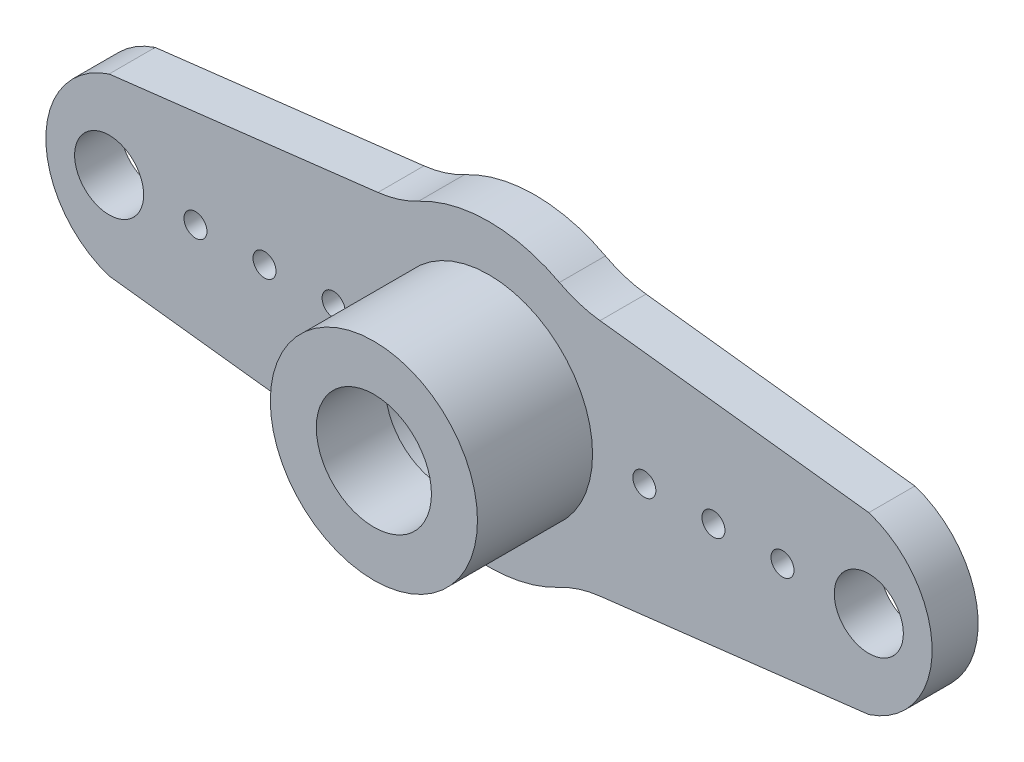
ISO-10303-21;
HEADER;
FILE_DESCRIPTION(('STEP AP214'),'2;1');
FILE_NAME('part.step','',(''),(''),'','','');
FILE_SCHEMA(('AUTOMOTIVE_DESIGN { 1 0 10303 214 1 1 1 1 }'));
ENDSEC;
DATA;
#1=APPLICATION_CONTEXT('core data for automotive mechanical design processes');
#2=APPLICATION_PROTOCOL_DEFINITION('international standard','automotive_design',2000,#1);
#3=PRODUCT_CONTEXT('',#1,'mechanical');
#4=PRODUCT('Part','Part','',(#3));
#5=PRODUCT_RELATED_PRODUCT_CATEGORY('part','',(#4));
#6=PRODUCT_DEFINITION_FORMATION('','',#4);
#7=PRODUCT_DEFINITION_CONTEXT('part definition',#1,'design');
#8=PRODUCT_DEFINITION('design','',#6,#7);
#9=PRODUCT_DEFINITION_SHAPE('','',#8);
#10=(LENGTH_UNIT() NAMED_UNIT(*) SI_UNIT(.MILLI.,.METRE.));
#11=(NAMED_UNIT(*) PLANE_ANGLE_UNIT() SI_UNIT($,.RADIAN.));
#12=(NAMED_UNIT(*) SI_UNIT($,.STERADIAN.) SOLID_ANGLE_UNIT());
#13=UNCERTAINTY_MEASURE_WITH_UNIT(LENGTH_MEASURE(1.E-05),#10,'distance_accuracy_value','');
#14=(GEOMETRIC_REPRESENTATION_CONTEXT(3) GLOBAL_UNCERTAINTY_ASSIGNED_CONTEXT((#13)) GLOBAL_UNIT_ASSIGNED_CONTEXT((#10,
#11,#12)) REPRESENTATION_CONTEXT('',''));
#15=CARTESIAN_POINT('',(0.,0.,0.));
#16=DIRECTION('',(0.,0.,1.));
#17=DIRECTION('',(1.,0.,0.));
#18=AXIS2_PLACEMENT_3D('',#15,#16,#17);
#19=CARTESIAN_POINT('',(0.,0.,7.));
#20=DIRECTION('',(0.,0.,-1.));
#21=DIRECTION('',(-1.,0.,0.));
#22=AXIS2_PLACEMENT_3D('',#19,#20,#21);
#23=CYLINDRICAL_SURFACE('',#22,2.5);
#24=CARTESIAN_POINT('',(0.,0.,7.));
#25=DIRECTION('',(0.,0.,1.));
#26=DIRECTION('',(1.,0.,0.));
#27=AXIS2_PLACEMENT_3D('',#24,#25,#26);
#28=CIRCLE('',#27,2.5);
#29=CARTESIAN_POINT('',(2.5,0.,7.));
#30=VERTEX_POINT('',#29);
#31=EDGE_CURVE('E254',#30,#30,#28,.T.);
#32=ORIENTED_EDGE('',*,*,#31,.T.);
#33=EDGE_LOOP('',(#32));
#34=FACE_BOUND('',#33,.T.);
#35=CARTESIAN_POINT('',(0.,0.,4.));
#36=DIRECTION('',(0.,0.,-1.));
#37=DIRECTION('',(-1.,0.,0.));
#38=AXIS2_PLACEMENT_3D('',#35,#36,#37);
#39=CIRCLE('',#38,2.5);
#40=CARTESIAN_POINT('',(-2.5,0.,4.));
#41=VERTEX_POINT('',#40);
#42=EDGE_CURVE('E219',#41,#41,#39,.T.);
#43=ORIENTED_EDGE('',*,*,#42,.T.);
#44=EDGE_LOOP('',(#43));
#45=FACE_BOUND('',#44,.T.);
#46=ADVANCED_FACE('F34',(#34,#45),#23,.F.);
#47=CARTESIAN_POINT('',(-5.41101843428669,10.1474567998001,2.));
#48=DIRECTION('',(0.,0.,1.));
#49=DIRECTION('',(1.,0.,0.));
#50=AXIS2_PLACEMENT_3D('',#47,#48,#49);
#51=PLANE('',#50);
#52=CARTESIAN_POINT('',(-16.5,0.,2.));
#53=DIRECTION('',(0.,0.,1.));
#54=DIRECTION('',(1.,0.,0.));
#55=AXIS2_PLACEMENT_3D('',#52,#53,#54);
#56=CIRCLE('',#55,1.5);
#57=CARTESIAN_POINT('',(-15.,0.,2.));
#58=VERTEX_POINT('',#57);
#59=EDGE_CURVE('E236',#58,#58,#56,.T.);
#60=ORIENTED_EDGE('',*,*,#59,.F.);
#61=EDGE_LOOP('',(#60));
#62=FACE_BOUND('',#61,.T.);
#63=CARTESIAN_POINT('',(16.5,0.,2.));
#64=DIRECTION('',(0.,0.,1.));
#65=DIRECTION('',(1.,0.,0.));
#66=AXIS2_PLACEMENT_3D('',#63,#64,#65);
#67=CIRCLE('',#66,1.5);
#68=CARTESIAN_POINT('',(18.,0.,2.));
#69=VERTEX_POINT('',#68);
#70=EDGE_CURVE('E226',#69,#69,#67,.T.);
#71=ORIENTED_EDGE('',*,*,#70,.F.);
#72=EDGE_LOOP('',(#71));
#73=FACE_BOUND('',#72,.T.);
#74=CARTESIAN_POINT('',(12.75,0.,2.));
#75=DIRECTION('',(0.,0.,1.));
#76=DIRECTION('',(-1.,0.,0.));
#77=AXIS2_PLACEMENT_3D('',#74,#75,#76);
#78=CIRCLE('',#77,0.499999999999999);
#79=CARTESIAN_POINT('',(12.25,0.,2.));
#80=VERTEX_POINT('',#79);
#81=EDGE_CURVE('E270',#80,#80,#78,.T.);
#82=ORIENTED_EDGE('',*,*,#81,.F.);
#83=EDGE_LOOP('',(#82));
#84=FACE_BOUND('',#83,.T.);
#85=CARTESIAN_POINT('',(6.75,0.,2.));
#86=DIRECTION('',(0.,0.,1.));
#87=DIRECTION('',(-1.,0.,0.));
#88=AXIS2_PLACEMENT_3D('',#85,#86,#87);
#89=CIRCLE('',#88,0.499999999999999);
#90=CARTESIAN_POINT('',(6.25,0.,2.));
#91=VERTEX_POINT('',#90);
#92=EDGE_CURVE('E282',#91,#91,#89,.T.);
#93=ORIENTED_EDGE('',*,*,#92,.F.);
#94=EDGE_LOOP('',(#93));
#95=FACE_BOUND('',#94,.T.);
#96=CARTESIAN_POINT('',(-9.75,0.,2.));
#97=DIRECTION('',(0.,0.,1.));
#98=DIRECTION('',(1.,0.,0.));
#99=AXIS2_PLACEMENT_3D('',#96,#97,#98);
#100=CIRCLE('',#99,0.499999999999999);
#101=CARTESIAN_POINT('',(-9.25,0.,2.));
#102=VERTEX_POINT('',#101);
#103=EDGE_CURVE('E300',#102,#102,#100,.T.);
#104=ORIENTED_EDGE('',*,*,#103,.F.);
#105=EDGE_LOOP('',(#104));
#106=FACE_BOUND('',#105,.T.);
#107=CARTESIAN_POINT('',(-5.41101843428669,10.1474567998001,2.));
#108=DIRECTION('',(0.,0.,-1.));
#109=DIRECTION('',(1.,0.,0.));
#110=AXIS2_PLACEMENT_3D('',#107,#108,#109);
#111=CIRCLE('',#110,5.);
#112=CARTESIAN_POINT('',(-3.05840172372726,5.73551906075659,2.));
#113=VERTEX_POINT('',#112);
#114=CARTESIAN_POINT('',(-4.82315587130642,5.18213529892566,2.));
#115=VERTEX_POINT('',#114);
#116=EDGE_CURVE('E193',#113,#115,#111,.T.);
#117=ORIENTED_EDGE('',*,*,#116,.T.);
#118=DIRECTION('',(-0.993064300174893,-0.117572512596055,0.));
#119=VECTOR('',#118,1.);
#120=CARTESIAN_POINT('',(-16.5,3.79967103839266,2.));
#121=LINE('',#120,#119);
#122=CARTESIAN_POINT('',(-16.5,3.79967103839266,2.));
#123=VERTEX_POINT('',#122);
#124=EDGE_CURVE('E113',#115,#123,#121,.T.);
#125=ORIENTED_EDGE('',*,*,#124,.T.);
#126=CARTESIAN_POINT('',(-15.25,0.,2.));
#127=DIRECTION('',(0.,0.,1.));
#128=DIRECTION('',(1.,0.,0.));
#129=AXIS2_PLACEMENT_3D('',#126,#127,#128);
#130=CIRCLE('',#129,4.);
#131=CARTESIAN_POINT('',(-16.5,-3.79967103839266,2.));
#132=VERTEX_POINT('',#131);
#133=EDGE_CURVE('E312',#123,#132,#130,.T.);
#134=ORIENTED_EDGE('',*,*,#133,.T.);
#135=DIRECTION('',(0.993064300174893,-0.117572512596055,0.));
#136=VECTOR('',#135,1.);
#137=CARTESIAN_POINT('',(-16.5,-3.79967103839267,2.));
#138=LINE('',#137,#136);
#139=CARTESIAN_POINT('',(-4.82315587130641,-5.18213529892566,2.));
#140=VERTEX_POINT('',#139);
#141=EDGE_CURVE('E314',#132,#140,#138,.T.);
#142=ORIENTED_EDGE('',*,*,#141,.T.);
#143=CARTESIAN_POINT('',(-5.41101843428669,-10.1474567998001,2.));
#144=DIRECTION('',(0.,0.,-1.));
#145=DIRECTION('',(-1.,0.,0.));
#146=AXIS2_PLACEMENT_3D('',#143,#144,#145);
#147=CIRCLE('',#146,5.);
#148=CARTESIAN_POINT('',(-3.05840172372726,-5.73551906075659,2.));
#149=VERTEX_POINT('',#148);
#150=EDGE_CURVE('E316',#140,#149,#147,.T.);
#151=ORIENTED_EDGE('',*,*,#150,.T.);
#152=CARTESIAN_POINT('',(0.,0.,2.));
#153=DIRECTION('',(0.,0.,1.));
#154=DIRECTION('',(1.,0.,0.));
#155=AXIS2_PLACEMENT_3D('',#152,#153,#154);
#156=CIRCLE('',#155,6.5);
#157=CARTESIAN_POINT('',(3.05840172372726,-5.73551906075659,2.));
#158=VERTEX_POINT('',#157);
#159=EDGE_CURVE('E318',#149,#158,#156,.T.);
#160=ORIENTED_EDGE('',*,*,#159,.T.);
#161=CARTESIAN_POINT('',(5.41101843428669,-10.1474567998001,2.));
#162=DIRECTION('',(0.,0.,-1.));
#163=DIRECTION('',(-1.,0.,0.));
#164=AXIS2_PLACEMENT_3D('',#161,#162,#163);
#165=CIRCLE('',#164,5.);
#166=CARTESIAN_POINT('',(4.82315587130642,-5.18213529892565,2.));
#167=VERTEX_POINT('',#166);
#168=EDGE_CURVE('E320',#158,#167,#165,.T.);
#169=ORIENTED_EDGE('',*,*,#168,.T.);
#170=DIRECTION('',(0.993064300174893,0.117572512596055,0.));
#171=VECTOR('',#170,1.);
#172=CARTESIAN_POINT('',(16.5,-3.79967103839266,2.));
#173=LINE('',#172,#171);
#174=CARTESIAN_POINT('',(16.5,-3.79967103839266,2.));
#175=VERTEX_POINT('',#174);
#176=EDGE_CURVE('E322',#167,#175,#173,.T.);
#177=ORIENTED_EDGE('',*,*,#176,.T.);
#178=CARTESIAN_POINT('',(15.25,0.,2.));
#179=DIRECTION('',(0.,0.,1.));
#180=DIRECTION('',(-1.,0.,0.));
#181=AXIS2_PLACEMENT_3D('',#178,#179,#180);
#182=CIRCLE('',#181,4.);
#183=CARTESIAN_POINT('',(16.5,3.79967103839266,2.));
#184=VERTEX_POINT('',#183);
#185=EDGE_CURVE('E148',#175,#184,#182,.T.);
#186=ORIENTED_EDGE('',*,*,#185,.T.);
#187=DIRECTION('',(-0.993064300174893,0.117572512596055,0.));
#188=VECTOR('',#187,1.);
#189=CARTESIAN_POINT('',(16.5,3.79967103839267,2.));
#190=LINE('',#189,#188);
#191=CARTESIAN_POINT('',(4.82315587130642,5.18213529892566,2.));
#192=VERTEX_POINT('',#191);
#193=EDGE_CURVE('E140',#184,#192,#190,.T.);
#194=ORIENTED_EDGE('',*,*,#193,.T.);
#195=CARTESIAN_POINT('',(5.41101843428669,10.1474567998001,2.));
#196=DIRECTION('',(0.,0.,-1.));
#197=DIRECTION('',(1.,0.,0.));
#198=AXIS2_PLACEMENT_3D('',#195,#196,#197);
#199=CIRCLE('',#198,5.);
#200=CARTESIAN_POINT('',(3.05840172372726,5.73551906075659,2.));
#201=VERTEX_POINT('',#200);
#202=EDGE_CURVE('E145',#192,#201,#199,.T.);
#203=ORIENTED_EDGE('',*,*,#202,.T.);
#204=CARTESIAN_POINT('',(0.,0.,2.));
#205=DIRECTION('',(0.,0.,1.));
#206=DIRECTION('',(1.,0.,0.));
#207=AXIS2_PLACEMENT_3D('',#204,#205,#206);
#208=CIRCLE('',#207,6.5);
#209=EDGE_CURVE('E59',#201,#113,#208,.T.);
#210=ORIENTED_EDGE('',*,*,#209,.T.);
#211=EDGE_LOOP('',(#117,#125,#134,#142,#151,#160,#169,#177,#186,#194,#203,#210));
#212=FACE_BOUND('',#211,.T.);
#213=CARTESIAN_POINT('',(-12.75,0.,2.));
#214=DIRECTION('',(0.,0.,1.));
#215=DIRECTION('',(1.,0.,0.));
#216=AXIS2_PLACEMENT_3D('',#213,#214,#215);
#217=CIRCLE('',#216,0.499999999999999);
#218=CARTESIAN_POINT('',(-12.25,0.,2.));
#219=VERTEX_POINT('',#218);
#220=EDGE_CURVE('E173',#219,#219,#217,.T.);
#221=ORIENTED_EDGE('',*,*,#220,.F.);
#222=EDGE_LOOP('',(#221));
#223=FACE_BOUND('',#222,.T.);
#224=CARTESIAN_POINT('',(-6.75,0.,2.));
#225=DIRECTION('',(0.,0.,1.));
#226=DIRECTION('',(1.,0.,0.));
#227=AXIS2_PLACEMENT_3D('',#224,#225,#226);
#228=CIRCLE('',#227,0.500000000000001);
#229=CARTESIAN_POINT('',(-6.25,0.,2.));
#230=VERTEX_POINT('',#229);
#231=EDGE_CURVE('E294',#230,#230,#228,.T.);
#232=ORIENTED_EDGE('',*,*,#231,.F.);
#233=EDGE_LOOP('',(#232));
#234=FACE_BOUND('',#233,.T.);
#235=CARTESIAN_POINT('',(9.75,0.,2.));
#236=DIRECTION('',(0.,0.,1.));
#237=DIRECTION('',(-1.,0.,0.));
#238=AXIS2_PLACEMENT_3D('',#235,#236,#237);
#239=CIRCLE('',#238,0.499999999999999);
#240=CARTESIAN_POINT('',(9.25,0.,2.));
#241=VERTEX_POINT('',#240);
#242=EDGE_CURVE('E276',#241,#241,#239,.T.);
#243=ORIENTED_EDGE('',*,*,#242,.F.);
#244=EDGE_LOOP('',(#243));
#245=FACE_BOUND('',#244,.T.);
#246=CARTESIAN_POINT('',(0.,0.,2.));
#247=DIRECTION('',(0.,0.,1.));
#248=DIRECTION('',(1.,0.,0.));
#249=AXIS2_PLACEMENT_3D('',#246,#247,#248);
#250=CIRCLE('',#249,4.5);
#251=CARTESIAN_POINT('',(4.5,0.,2.));
#252=VERTEX_POINT('',#251);
#253=EDGE_CURVE('E257',#252,#252,#250,.T.);
#254=ORIENTED_EDGE('',*,*,#253,.F.);
#255=EDGE_LOOP('',(#254));
#256=FACE_BOUND('',#255,.T.);
#257=ADVANCED_FACE('F142',(#62,#73,#84,#95,#106,#212,#223,#234,#245,#256),#51,.T.);
#258=CARTESIAN_POINT('',(-5.41101843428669,10.1474567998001,0.));
#259=DIRECTION('',(0.,0.,1.));
#260=DIRECTION('',(1.,0.,0.));
#261=AXIS2_PLACEMENT_3D('',#258,#259,#260);
#262=PLANE('',#261);
#263=CARTESIAN_POINT('',(-16.5,0.,0.));
#264=DIRECTION('',(0.,0.,1.));
#265=DIRECTION('',(1.,0.,0.));
#266=AXIS2_PLACEMENT_3D('',#263,#264,#265);
#267=CIRCLE('',#266,1.5);
#268=CARTESIAN_POINT('',(-15.,0.,0.));
#269=VERTEX_POINT('',#268);
#270=EDGE_CURVE('E38',#269,#269,#267,.T.);
#271=ORIENTED_EDGE('',*,*,#270,.T.);
#272=EDGE_LOOP('',(#271));
#273=FACE_BOUND('',#272,.T.);
#274=CARTESIAN_POINT('',(16.5,0.,0.));
#275=DIRECTION('',(0.,0.,1.));
#276=DIRECTION('',(1.,0.,0.));
#277=AXIS2_PLACEMENT_3D('',#274,#275,#276);
#278=CIRCLE('',#277,1.5);
#279=CARTESIAN_POINT('',(18.,0.,0.));
#280=VERTEX_POINT('',#279);
#281=EDGE_CURVE('E223',#280,#280,#278,.T.);
#282=ORIENTED_EDGE('',*,*,#281,.T.);
#283=EDGE_LOOP('',(#282));
#284=FACE_BOUND('',#283,.T.);
#285=CARTESIAN_POINT('',(12.75,0.,0.));
#286=DIRECTION('',(0.,0.,1.));
#287=DIRECTION('',(-1.,0.,0.));
#288=AXIS2_PLACEMENT_3D('',#285,#286,#287);
#289=CIRCLE('',#288,0.499999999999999);
#290=CARTESIAN_POINT('',(12.25,0.,0.));
#291=VERTEX_POINT('',#290);
#292=EDGE_CURVE('E269',#291,#291,#289,.T.);
#293=ORIENTED_EDGE('',*,*,#292,.T.);
#294=EDGE_LOOP('',(#293));
#295=FACE_BOUND('',#294,.T.);
#296=CARTESIAN_POINT('',(6.75,0.,0.));
#297=DIRECTION('',(0.,0.,1.));
#298=DIRECTION('',(-1.,0.,0.));
#299=AXIS2_PLACEMENT_3D('',#296,#297,#298);
#300=CIRCLE('',#299,0.499999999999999);
#301=CARTESIAN_POINT('',(6.25,0.,0.));
#302=VERTEX_POINT('',#301);
#303=EDGE_CURVE('E279',#302,#302,#300,.T.);
#304=ORIENTED_EDGE('',*,*,#303,.T.);
#305=EDGE_LOOP('',(#304));
#306=FACE_BOUND('',#305,.T.);
#307=CARTESIAN_POINT('',(3.75,0.,0.));
#308=DIRECTION('',(0.,0.,1.));
#309=DIRECTION('',(-1.,0.,0.));
#310=AXIS2_PLACEMENT_3D('',#307,#308,#309);
#311=CIRCLE('',#310,0.500000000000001);
#312=CARTESIAN_POINT('',(3.475,-0.417582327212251,0.));
#313=VERTEX_POINT('',#312);
#314=CARTESIAN_POINT('',(3.475,0.417582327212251,0.));
#315=VERTEX_POINT('',#314);
#316=EDGE_CURVE('E285',#313,#315,#311,.T.);
#317=ORIENTED_EDGE('',*,*,#316,.T.);
#318=CARTESIAN_POINT('',(0.,0.,0.));
#319=DIRECTION('',(0.,0.,-1.));
#320=DIRECTION('',(-1.,0.,0.));
#321=AXIS2_PLACEMENT_3D('',#318,#319,#320);
#322=CIRCLE('',#321,3.5);
#323=CARTESIAN_POINT('',(-3.475,0.417582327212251,0.));
#324=VERTEX_POINT('',#323);
#325=EDGE_CURVE('E229',#324,#315,#322,.T.);
#326=ORIENTED_EDGE('',*,*,#325,.F.);
#327=CARTESIAN_POINT('',(-3.75,0.,0.));
#328=DIRECTION('',(0.,0.,1.));
#329=DIRECTION('',(1.,0.,0.));
#330=AXIS2_PLACEMENT_3D('',#327,#328,#329);
#331=CIRCLE('',#330,0.500000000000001);
#332=CARTESIAN_POINT('',(-3.475,-0.417582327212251,0.));
#333=VERTEX_POINT('',#332);
#334=EDGE_CURVE('E290',#324,#333,#331,.T.);
#335=ORIENTED_EDGE('',*,*,#334,.T.);
#336=EDGE_CURVE('E225',#313,#333,#322,.T.);
#337=ORIENTED_EDGE('',*,*,#336,.F.);
#338=EDGE_LOOP('',(#317,#326,#335,#337));
#339=FACE_BOUND('',#338,.T.);
#340=CARTESIAN_POINT('',(-9.75,0.,0.));
#341=DIRECTION('',(0.,0.,1.));
#342=DIRECTION('',(1.,0.,0.));
#343=AXIS2_PLACEMENT_3D('',#340,#341,#342);
#344=CIRCLE('',#343,0.499999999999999);
#345=CARTESIAN_POINT('',(-9.25,0.,0.));
#346=VERTEX_POINT('',#345);
#347=EDGE_CURVE('E297',#346,#346,#344,.T.);
#348=ORIENTED_EDGE('',*,*,#347,.T.);
#349=EDGE_LOOP('',(#348));
#350=FACE_BOUND('',#349,.T.);
#351=CARTESIAN_POINT('',(-5.41101843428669,10.1474567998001,0.));
#352=DIRECTION('',(0.,0.,-1.));
#353=DIRECTION('',(1.,0.,0.));
#354=AXIS2_PLACEMENT_3D('',#351,#352,#353);
#355=CIRCLE('',#354,5.);
#356=CARTESIAN_POINT('',(-3.05840172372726,5.73551906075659,0.));
#357=VERTEX_POINT('',#356);
#358=CARTESIAN_POINT('',(-4.82315587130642,5.18213529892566,0.));
#359=VERTEX_POINT('',#358);
#360=EDGE_CURVE('E169',#357,#359,#355,.T.);
#361=ORIENTED_EDGE('',*,*,#360,.F.);
#362=CARTESIAN_POINT('',(0.,0.,0.));
#363=DIRECTION('',(0.,0.,1.));
#364=DIRECTION('',(1.,0.,0.));
#365=AXIS2_PLACEMENT_3D('',#362,#363,#364);
#366=CIRCLE('',#365,6.5);
#367=CARTESIAN_POINT('',(3.05840172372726,5.73551906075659,0.));
#368=VERTEX_POINT('',#367);
#369=EDGE_CURVE('E104',#368,#357,#366,.T.);
#370=ORIENTED_EDGE('',*,*,#369,.F.);
#371=CARTESIAN_POINT('',(5.41101843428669,10.1474567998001,0.));
#372=DIRECTION('',(0.,0.,-1.));
#373=DIRECTION('',(1.,0.,0.));
#374=AXIS2_PLACEMENT_3D('',#371,#372,#373);
#375=CIRCLE('',#374,5.);
#376=CARTESIAN_POINT('',(4.82315587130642,5.18213529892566,0.));
#377=VERTEX_POINT('',#376);
#378=EDGE_CURVE('E190',#377,#368,#375,.T.);
#379=ORIENTED_EDGE('',*,*,#378,.F.);
#380=DIRECTION('',(-0.993064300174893,0.117572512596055,0.));
#381=VECTOR('',#380,1.);
#382=CARTESIAN_POINT('',(16.5,3.79967103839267,0.));
#383=LINE('',#382,#381);
#384=CARTESIAN_POINT('',(16.5,3.79967103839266,0.));
#385=VERTEX_POINT('',#384);
#386=EDGE_CURVE('E157',#385,#377,#383,.T.);
#387=ORIENTED_EDGE('',*,*,#386,.F.);
#388=CARTESIAN_POINT('',(15.25,0.,0.));
#389=DIRECTION('',(0.,0.,1.));
#390=DIRECTION('',(-1.,0.,0.));
#391=AXIS2_PLACEMENT_3D('',#388,#389,#390);
#392=CIRCLE('',#391,4.);
#393=CARTESIAN_POINT('',(16.5,-3.79967103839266,0.));
#394=VERTEX_POINT('',#393);
#395=EDGE_CURVE('E187',#394,#385,#392,.T.);
#396=ORIENTED_EDGE('',*,*,#395,.F.);
#397=DIRECTION('',(0.993064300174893,0.117572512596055,0.));
#398=VECTOR('',#397,1.);
#399=CARTESIAN_POINT('',(16.5,-3.79967103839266,0.));
#400=LINE('',#399,#398);
#401=CARTESIAN_POINT('',(4.82315587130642,-5.18213529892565,0.));
#402=VERTEX_POINT('',#401);
#403=EDGE_CURVE('E185',#402,#394,#400,.T.);
#404=ORIENTED_EDGE('',*,*,#403,.F.);
#405=CARTESIAN_POINT('',(5.41101843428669,-10.1474567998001,0.));
#406=DIRECTION('',(0.,0.,-1.));
#407=DIRECTION('',(-1.,0.,0.));
#408=AXIS2_PLACEMENT_3D('',#405,#406,#407);
#409=CIRCLE('',#408,5.);
#410=CARTESIAN_POINT('',(3.05840172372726,-5.73551906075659,0.));
#411=VERTEX_POINT('',#410);
#412=EDGE_CURVE('E183',#411,#402,#409,.T.);
#413=ORIENTED_EDGE('',*,*,#412,.F.);
#414=CARTESIAN_POINT('',(0.,0.,0.));
#415=DIRECTION('',(0.,0.,1.));
#416=DIRECTION('',(1.,0.,0.));
#417=AXIS2_PLACEMENT_3D('',#414,#415,#416);
#418=CIRCLE('',#417,6.5);
#419=CARTESIAN_POINT('',(-3.05840172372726,-5.73551906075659,0.));
#420=VERTEX_POINT('',#419);
#421=EDGE_CURVE('E181',#420,#411,#418,.T.);
#422=ORIENTED_EDGE('',*,*,#421,.F.);
#423=CARTESIAN_POINT('',(-5.41101843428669,-10.1474567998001,0.));
#424=DIRECTION('',(0.,0.,-1.));
#425=DIRECTION('',(-1.,0.,0.));
#426=AXIS2_PLACEMENT_3D('',#423,#424,#425);
#427=CIRCLE('',#426,5.);
#428=CARTESIAN_POINT('',(-4.82315587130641,-5.18213529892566,0.));
#429=VERTEX_POINT('',#428);
#430=EDGE_CURVE('E179',#429,#420,#427,.T.);
#431=ORIENTED_EDGE('',*,*,#430,.F.);
#432=DIRECTION('',(0.993064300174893,-0.117572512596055,0.));
#433=VECTOR('',#432,1.);
#434=CARTESIAN_POINT('',(-16.5,-3.79967103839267,0.));
#435=LINE('',#434,#433);
#436=CARTESIAN_POINT('',(-16.5,-3.79967103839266,0.));
#437=VERTEX_POINT('',#436);
#438=EDGE_CURVE('E177',#437,#429,#435,.T.);
#439=ORIENTED_EDGE('',*,*,#438,.F.);
#440=CARTESIAN_POINT('',(-15.25,0.,0.));
#441=DIRECTION('',(0.,0.,1.));
#442=DIRECTION('',(1.,0.,0.));
#443=AXIS2_PLACEMENT_3D('',#440,#441,#442);
#444=CIRCLE('',#443,4.);
#445=CARTESIAN_POINT('',(-16.5,3.79967103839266,0.));
#446=VERTEX_POINT('',#445);
#447=EDGE_CURVE('E175',#446,#437,#444,.T.);
#448=ORIENTED_EDGE('',*,*,#447,.F.);
#449=DIRECTION('',(-0.993064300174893,-0.117572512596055,0.));
#450=VECTOR('',#449,1.);
#451=CARTESIAN_POINT('',(-16.5,3.79967103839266,0.));
#452=LINE('',#451,#450);
#453=EDGE_CURVE('E172',#359,#446,#452,.T.);
#454=ORIENTED_EDGE('',*,*,#453,.F.);
#455=EDGE_LOOP('',(#361,#370,#379,#387,#396,#404,#413,#422,#431,#439,#448,#454));
#456=FACE_BOUND('',#455,.T.);
#457=CARTESIAN_POINT('',(-12.75,0.,0.));
#458=DIRECTION('',(0.,0.,1.));
#459=DIRECTION('',(1.,0.,0.));
#460=AXIS2_PLACEMENT_3D('',#457,#458,#459);
#461=CIRCLE('',#460,0.499999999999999);
#462=CARTESIAN_POINT('',(-12.25,0.,0.));
#463=VERTEX_POINT('',#462);
#464=EDGE_CURVE('E303',#463,#463,#461,.T.);
#465=ORIENTED_EDGE('',*,*,#464,.T.);
#466=EDGE_LOOP('',(#465));
#467=FACE_BOUND('',#466,.T.);
#468=CARTESIAN_POINT('',(-6.75,0.,0.));
#469=DIRECTION('',(0.,0.,1.));
#470=DIRECTION('',(1.,0.,0.));
#471=AXIS2_PLACEMENT_3D('',#468,#469,#470);
#472=CIRCLE('',#471,0.500000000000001);
#473=CARTESIAN_POINT('',(-6.25,0.,0.));
#474=VERTEX_POINT('',#473);
#475=EDGE_CURVE('E293',#474,#474,#472,.T.);
#476=ORIENTED_EDGE('',*,*,#475,.T.);
#477=EDGE_LOOP('',(#476));
#478=FACE_BOUND('',#477,.T.);
#479=CARTESIAN_POINT('',(9.75,0.,0.));
#480=DIRECTION('',(0.,0.,1.));
#481=DIRECTION('',(-1.,0.,0.));
#482=AXIS2_PLACEMENT_3D('',#479,#480,#481);
#483=CIRCLE('',#482,0.499999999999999);
#484=CARTESIAN_POINT('',(9.25,0.,0.));
#485=VERTEX_POINT('',#484);
#486=EDGE_CURVE('E273',#485,#485,#483,.T.);
#487=ORIENTED_EDGE('',*,*,#486,.T.);
#488=EDGE_LOOP('',(#487));
#489=FACE_BOUND('',#488,.T.);
#490=ADVANCED_FACE('F335',(#273,#284,#295,#306,#339,#350,#456,#467,#478,#489),#262,.F.);
#491=CARTESIAN_POINT('',(-5.41101843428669,10.1474567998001,2.));
#492=DIRECTION('',(0.,0.,-1.));
#493=DIRECTION('',(-1.,0.,0.));
#494=AXIS2_PLACEMENT_3D('',#491,#492,#493);
#495=CYLINDRICAL_SURFACE('',#494,5.);
#496=ORIENTED_EDGE('',*,*,#360,.T.);
#497=DIRECTION('',(0.,0.,-1.));
#498=VECTOR('',#497,1.);
#499=CARTESIAN_POINT('',(-4.82315587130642,5.18213529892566,2.));
#500=LINE('',#499,#498);
#501=EDGE_CURVE('E43',#115,#359,#500,.T.);
#502=ORIENTED_EDGE('',*,*,#501,.F.);
#503=ORIENTED_EDGE('',*,*,#116,.F.);
#504=DIRECTION('',(0.,0.,-1.));
#505=VECTOR('',#504,1.);
#506=CARTESIAN_POINT('',(-3.05840172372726,5.73551906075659,2.));
#507=LINE('',#506,#505);
#508=EDGE_CURVE('E165',#113,#357,#507,.T.);
#509=ORIENTED_EDGE('',*,*,#508,.T.);
#510=EDGE_LOOP('',(#496,#502,#503,#509));
#511=FACE_BOUND('',#510,.T.);
#512=ADVANCED_FACE('F36',(#511),#495,.F.);
#513=CARTESIAN_POINT('',(-16.5,3.79967103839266,2.));
#514=DIRECTION('',(0.117572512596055,-0.993064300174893,0.));
#515=DIRECTION('',(0.993064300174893,0.117572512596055,0.));
#516=AXIS2_PLACEMENT_3D('',#513,#514,#515);
#517=PLANE('',#516);
#518=ORIENTED_EDGE('',*,*,#453,.T.);
#519=DIRECTION('',(0.,0.,-1.));
#520=VECTOR('',#519,1.);
#521=CARTESIAN_POINT('',(-16.5,3.79967103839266,2.));
#522=LINE('',#521,#520);
#523=EDGE_CURVE('E215',#123,#446,#522,.T.);
#524=ORIENTED_EDGE('',*,*,#523,.F.);
#525=ORIENTED_EDGE('',*,*,#124,.F.);
#526=ORIENTED_EDGE('',*,*,#501,.T.);
#527=EDGE_LOOP('',(#518,#524,#525,#526));
#528=FACE_BOUND('',#527,.T.);
#529=ADVANCED_FACE('F343',(#528),#517,.F.);
#530=CARTESIAN_POINT('',(-15.25,0.,2.));
#531=DIRECTION('',(0.,0.,-1.));
#532=DIRECTION('',(-1.,0.,0.));
#533=AXIS2_PLACEMENT_3D('',#530,#531,#532);
#534=CYLINDRICAL_SURFACE('',#533,4.);
#535=ORIENTED_EDGE('',*,*,#447,.T.);
#536=DIRECTION('',(0.,0.,-1.));
#537=VECTOR('',#536,1.);
#538=CARTESIAN_POINT('',(-16.5,-3.79967103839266,2.));
#539=LINE('',#538,#537);
#540=EDGE_CURVE('E212',#132,#437,#539,.T.);
#541=ORIENTED_EDGE('',*,*,#540,.F.);
#542=ORIENTED_EDGE('',*,*,#133,.F.);
#543=ORIENTED_EDGE('',*,*,#523,.T.);
#544=EDGE_LOOP('',(#535,#541,#542,#543));
#545=FACE_BOUND('',#544,.T.);
#546=ADVANCED_FACE('F346',(#545),#534,.T.);
#547=CARTESIAN_POINT('',(-16.5,-3.79967103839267,2.));
#548=DIRECTION('',(0.117572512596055,0.993064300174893,0.));
#549=DIRECTION('',(-0.993064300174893,0.117572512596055,0.));
#550=AXIS2_PLACEMENT_3D('',#547,#548,#549);
#551=PLANE('',#550);
#552=ORIENTED_EDGE('',*,*,#438,.T.);
#553=DIRECTION('',(0.,0.,-1.));
#554=VECTOR('',#553,1.);
#555=CARTESIAN_POINT('',(-4.82315587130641,-5.18213529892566,2.));
#556=LINE('',#555,#554);
#557=EDGE_CURVE('E209',#140,#429,#556,.T.);
#558=ORIENTED_EDGE('',*,*,#557,.F.);
#559=ORIENTED_EDGE('',*,*,#141,.F.);
#560=ORIENTED_EDGE('',*,*,#540,.T.);
#561=EDGE_LOOP('',(#552,#558,#559,#560));
#562=FACE_BOUND('',#561,.T.);
#563=ADVANCED_FACE('F351',(#562),#551,.F.);
#564=CARTESIAN_POINT('',(-5.41101843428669,-10.1474567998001,2.));
#565=DIRECTION('',(0.,0.,-1.));
#566=DIRECTION('',(-1.,0.,0.));
#567=AXIS2_PLACEMENT_3D('',#564,#565,#566);
#568=CYLINDRICAL_SURFACE('',#567,5.);
#569=ORIENTED_EDGE('',*,*,#430,.T.);
#570=DIRECTION('',(0.,0.,-1.));
#571=VECTOR('',#570,1.);
#572=CARTESIAN_POINT('',(-3.05840172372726,-5.73551906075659,2.));
#573=LINE('',#572,#571);
#574=EDGE_CURVE('E206',#149,#420,#573,.T.);
#575=ORIENTED_EDGE('',*,*,#574,.F.);
#576=ORIENTED_EDGE('',*,*,#150,.F.);
#577=ORIENTED_EDGE('',*,*,#557,.T.);
#578=EDGE_LOOP('',(#569,#575,#576,#577));
#579=FACE_BOUND('',#578,.T.);
#580=ADVANCED_FACE('F357',(#579),#568,.F.);
#581=CARTESIAN_POINT('',(0.,0.,2.));
#582=DIRECTION('',(0.,0.,-1.));
#583=DIRECTION('',(-1.,0.,0.));
#584=AXIS2_PLACEMENT_3D('',#581,#582,#583);
#585=CYLINDRICAL_SURFACE('',#584,6.5);
#586=ORIENTED_EDGE('',*,*,#421,.T.);
#587=DIRECTION('',(0.,0.,-1.));
#588=VECTOR('',#587,1.);
#589=CARTESIAN_POINT('',(3.05840172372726,-5.73551906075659,2.));
#590=LINE('',#589,#588);
#591=EDGE_CURVE('E203',#158,#411,#590,.T.);
#592=ORIENTED_EDGE('',*,*,#591,.F.);
#593=ORIENTED_EDGE('',*,*,#159,.F.);
#594=ORIENTED_EDGE('',*,*,#574,.T.);
#595=EDGE_LOOP('',(#586,#592,#593,#594));
#596=FACE_BOUND('',#595,.T.);
#597=ADVANCED_FACE('F361',(#596),#585,.T.);
#598=CARTESIAN_POINT('',(5.41101843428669,-10.1474567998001,2.));
#599=DIRECTION('',(0.,0.,-1.));
#600=DIRECTION('',(-1.,0.,0.));
#601=AXIS2_PLACEMENT_3D('',#598,#599,#600);
#602=CYLINDRICAL_SURFACE('',#601,5.);
#603=ORIENTED_EDGE('',*,*,#412,.T.);
#604=DIRECTION('',(0.,0.,-1.));
#605=VECTOR('',#604,1.);
#606=CARTESIAN_POINT('',(4.82315587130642,-5.18213529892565,2.));
#607=LINE('',#606,#605);
#608=EDGE_CURVE('E200',#167,#402,#607,.T.);
#609=ORIENTED_EDGE('',*,*,#608,.F.);
#610=ORIENTED_EDGE('',*,*,#168,.F.);
#611=ORIENTED_EDGE('',*,*,#591,.T.);
#612=EDGE_LOOP('',(#603,#609,#610,#611));
#613=FACE_BOUND('',#612,.T.);
#614=ADVANCED_FACE('F364',(#613),#602,.F.);
#615=CARTESIAN_POINT('',(16.5,-3.79967103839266,2.));
#616=DIRECTION('',(-0.117572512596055,0.993064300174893,0.));
#617=DIRECTION('',(-0.993064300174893,-0.117572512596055,0.));
#618=AXIS2_PLACEMENT_3D('',#615,#616,#617);
#619=PLANE('',#618);
#620=ORIENTED_EDGE('',*,*,#403,.T.);
#621=DIRECTION('',(0.,0.,-1.));
#622=VECTOR('',#621,1.);
#623=CARTESIAN_POINT('',(16.5,-3.79967103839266,2.));
#624=LINE('',#623,#622);
#625=EDGE_CURVE('E197',#175,#394,#624,.T.);
#626=ORIENTED_EDGE('',*,*,#625,.F.);
#627=ORIENTED_EDGE('',*,*,#176,.F.);
#628=ORIENTED_EDGE('',*,*,#608,.T.);
#629=EDGE_LOOP('',(#620,#626,#627,#628));
#630=FACE_BOUND('',#629,.T.);
#631=ADVANCED_FACE('F328',(#630),#619,.F.);
#632=CARTESIAN_POINT('',(15.25,0.,2.));
#633=DIRECTION('',(0.,0.,-1.));
#634=DIRECTION('',(-1.,0.,0.));
#635=AXIS2_PLACEMENT_3D('',#632,#633,#634);
#636=CYLINDRICAL_SURFACE('',#635,4.);
#637=ORIENTED_EDGE('',*,*,#395,.T.);
#638=DIRECTION('',(0.,0.,-1.));
#639=VECTOR('',#638,1.);
#640=CARTESIAN_POINT('',(16.5,3.79967103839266,2.));
#641=LINE('',#640,#639);
#642=EDGE_CURVE('E160',#184,#385,#641,.T.);
#643=ORIENTED_EDGE('',*,*,#642,.F.);
#644=ORIENTED_EDGE('',*,*,#185,.F.);
#645=ORIENTED_EDGE('',*,*,#625,.T.);
#646=EDGE_LOOP('',(#637,#643,#644,#645));
#647=FACE_BOUND('',#646,.T.);
#648=ADVANCED_FACE('F332',(#647),#636,.T.);
#649=CARTESIAN_POINT('',(16.5,3.79967103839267,2.));
#650=DIRECTION('',(-0.117572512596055,-0.993064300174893,0.));
#651=DIRECTION('',(0.993064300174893,-0.117572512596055,0.));
#652=AXIS2_PLACEMENT_3D('',#649,#650,#651);
#653=PLANE('',#652);
#654=ORIENTED_EDGE('',*,*,#386,.T.);
#655=DIRECTION('',(0.,0.,-1.));
#656=VECTOR('',#655,1.);
#657=CARTESIAN_POINT('',(4.82315587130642,5.18213529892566,2.));
#658=LINE('',#657,#656);
#659=EDGE_CURVE('E154',#192,#377,#658,.T.);
#660=ORIENTED_EDGE('',*,*,#659,.F.);
#661=ORIENTED_EDGE('',*,*,#193,.F.);
#662=ORIENTED_EDGE('',*,*,#642,.T.);
#663=EDGE_LOOP('',(#654,#660,#661,#662));
#664=FACE_BOUND('',#663,.T.);
#665=ADVANCED_FACE('F155',(#664),#653,.F.);
#666=CARTESIAN_POINT('',(5.41101843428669,10.1474567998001,2.));
#667=DIRECTION('',(0.,0.,-1.));
#668=DIRECTION('',(-1.,0.,0.));
#669=AXIS2_PLACEMENT_3D('',#666,#667,#668);
#670=CYLINDRICAL_SURFACE('',#669,5.);
#671=ORIENTED_EDGE('',*,*,#378,.T.);
#672=DIRECTION('',(0.,0.,-1.));
#673=VECTOR('',#672,1.);
#674=CARTESIAN_POINT('',(3.05840172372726,5.73551906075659,2.));
#675=LINE('',#674,#673);
#676=EDGE_CURVE('E161',#201,#368,#675,.T.);
#677=ORIENTED_EDGE('',*,*,#676,.F.);
#678=ORIENTED_EDGE('',*,*,#202,.F.);
#679=ORIENTED_EDGE('',*,*,#659,.T.);
#680=EDGE_LOOP('',(#671,#677,#678,#679));
#681=FACE_BOUND('',#680,.T.);
#682=ADVANCED_FACE('F163',(#681),#670,.F.);
#683=CARTESIAN_POINT('',(0.,0.,2.));
#684=DIRECTION('',(0.,0.,-1.));
#685=DIRECTION('',(-1.,0.,0.));
#686=AXIS2_PLACEMENT_3D('',#683,#684,#685);
#687=CYLINDRICAL_SURFACE('',#686,6.5);
#688=ORIENTED_EDGE('',*,*,#369,.T.);
#689=ORIENTED_EDGE('',*,*,#508,.F.);
#690=ORIENTED_EDGE('',*,*,#209,.F.);
#691=ORIENTED_EDGE('',*,*,#676,.T.);
#692=EDGE_LOOP('',(#688,#689,#690,#691));
#693=FACE_BOUND('',#692,.T.);
#694=ADVANCED_FACE('F337',(#693),#687,.T.);
#695=CARTESIAN_POINT('',(-12.75,0.,2.));
#696=DIRECTION('',(0.,0.,-1.));
#697=DIRECTION('',(-1.,0.,0.));
#698=AXIS2_PLACEMENT_3D('',#695,#696,#697);
#699=CYLINDRICAL_SURFACE('',#698,0.499999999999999);
#700=ORIENTED_EDGE('',*,*,#220,.T.);
#701=EDGE_LOOP('',(#700));
#702=FACE_BOUND('',#701,.T.);
#703=ORIENTED_EDGE('',*,*,#464,.F.);
#704=EDGE_LOOP('',(#703));
#705=FACE_BOUND('',#704,.T.);
#706=ADVANCED_FACE('F426',(#702,#705),#699,.F.);
#707=CARTESIAN_POINT('',(-9.75,0.,2.));
#708=DIRECTION('',(0.,0.,-1.));
#709=DIRECTION('',(-1.,0.,0.));
#710=AXIS2_PLACEMENT_3D('',#707,#708,#709);
#711=CYLINDRICAL_SURFACE('',#710,0.499999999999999);
#712=ORIENTED_EDGE('',*,*,#103,.T.);
#713=EDGE_LOOP('',(#712));
#714=FACE_BOUND('',#713,.T.);
#715=ORIENTED_EDGE('',*,*,#347,.F.);
#716=EDGE_LOOP('',(#715));
#717=FACE_BOUND('',#716,.T.);
#718=ADVANCED_FACE('F422',(#714,#717),#711,.F.);
#719=CARTESIAN_POINT('',(-6.75,0.,2.));
#720=DIRECTION('',(0.,0.,-1.));
#721=DIRECTION('',(-1.,0.,0.));
#722=AXIS2_PLACEMENT_3D('',#719,#720,#721);
#723=CYLINDRICAL_SURFACE('',#722,0.500000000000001);
#724=ORIENTED_EDGE('',*,*,#231,.T.);
#725=EDGE_LOOP('',(#724));
#726=FACE_BOUND('',#725,.T.);
#727=ORIENTED_EDGE('',*,*,#475,.F.);
#728=EDGE_LOOP('',(#727));
#729=FACE_BOUND('',#728,.T.);
#730=ADVANCED_FACE('F418',(#726,#729),#723,.F.);
#731=CARTESIAN_POINT('',(-3.75,0.,2.));
#732=DIRECTION('',(0.,0.,-1.));
#733=DIRECTION('',(-1.,0.,0.));
#734=AXIS2_PLACEMENT_3D('',#731,#732,#733);
#735=CYLINDRICAL_SURFACE('',#734,0.500000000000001);
#736=DIRECTION('',(0.,0.,-1.));
#737=VECTOR('',#736,1.);
#738=CARTESIAN_POINT('',(-3.475,-0.417582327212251,2.));
#739=LINE('',#738,#737);
#740=CARTESIAN_POINT('',(-3.475,-0.417582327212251,2.));
#741=VERTEX_POINT('',#740);
#742=EDGE_CURVE('E51',#333,#741,#739,.F.);
#743=ORIENTED_EDGE('',*,*,#742,.F.);
#744=ORIENTED_EDGE('',*,*,#334,.F.);
#745=DIRECTION('',(0.,0.,-1.));
#746=VECTOR('',#745,1.);
#747=CARTESIAN_POINT('',(-3.475,0.417582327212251,2.));
#748=LINE('',#747,#746);
#749=CARTESIAN_POINT('',(-3.475,0.417582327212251,2.));
#750=VERTEX_POINT('',#749);
#751=EDGE_CURVE('E221',#750,#324,#748,.T.);
#752=ORIENTED_EDGE('',*,*,#751,.F.);
#753=CARTESIAN_POINT('',(-3.75,0.,2.));
#754=DIRECTION('',(0.,0.,1.));
#755=DIRECTION('',(1.,0.,0.));
#756=AXIS2_PLACEMENT_3D('',#753,#754,#755);
#757=CIRCLE('',#756,0.500000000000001);
#758=EDGE_CURVE('E266',#750,#741,#757,.T.);
#759=ORIENTED_EDGE('',*,*,#758,.T.);
#760=EDGE_LOOP('',(#743,#744,#752,#759));
#761=FACE_BOUND('',#760,.T.);
#762=ADVANCED_FACE('F414',(#761),#735,.F.);
#763=CARTESIAN_POINT('',(3.75,0.,2.));
#764=DIRECTION('',(0.,0.,-1.));
#765=DIRECTION('',(-1.,0.,0.));
#766=AXIS2_PLACEMENT_3D('',#763,#764,#765);
#767=CYLINDRICAL_SURFACE('',#766,0.500000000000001);
#768=DIRECTION('',(0.,0.,-1.));
#769=VECTOR('',#768,1.);
#770=CARTESIAN_POINT('',(3.475,0.417582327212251,2.));
#771=LINE('',#770,#769);
#772=CARTESIAN_POINT('',(3.475,0.417582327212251,2.));
#773=VERTEX_POINT('',#772);
#774=EDGE_CURVE('E251',#315,#773,#771,.F.);
#775=ORIENTED_EDGE('',*,*,#774,.F.);
#776=ORIENTED_EDGE('',*,*,#316,.F.);
#777=DIRECTION('',(0.,0.,-1.));
#778=VECTOR('',#777,1.);
#779=CARTESIAN_POINT('',(3.475,-0.417582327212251,2.));
#780=LINE('',#779,#778);
#781=CARTESIAN_POINT('',(3.475,-0.417582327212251,2.));
#782=VERTEX_POINT('',#781);
#783=EDGE_CURVE('E248',#782,#313,#780,.T.);
#784=ORIENTED_EDGE('',*,*,#783,.F.);
#785=CARTESIAN_POINT('',(3.75,0.,2.));
#786=DIRECTION('',(0.,0.,1.));
#787=DIRECTION('',(1.,0.,0.));
#788=AXIS2_PLACEMENT_3D('',#785,#786,#787);
#789=CIRCLE('',#788,0.500000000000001);
#790=EDGE_CURVE('E261',#782,#773,#789,.T.);
#791=ORIENTED_EDGE('',*,*,#790,.T.);
#792=EDGE_LOOP('',(#775,#776,#784,#791));
#793=FACE_BOUND('',#792,.T.);
#794=ADVANCED_FACE('F410',(#793),#767,.F.);
#795=CARTESIAN_POINT('',(6.75,0.,2.));
#796=DIRECTION('',(0.,0.,-1.));
#797=DIRECTION('',(-1.,0.,0.));
#798=AXIS2_PLACEMENT_3D('',#795,#796,#797);
#799=CYLINDRICAL_SURFACE('',#798,0.499999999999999);
#800=ORIENTED_EDGE('',*,*,#92,.T.);
#801=EDGE_LOOP('',(#800));
#802=FACE_BOUND('',#801,.T.);
#803=ORIENTED_EDGE('',*,*,#303,.F.);
#804=EDGE_LOOP('',(#803));
#805=FACE_BOUND('',#804,.T.);
#806=ADVANCED_FACE('F406',(#802,#805),#799,.F.);
#807=CARTESIAN_POINT('',(9.75,0.,2.));
#808=DIRECTION('',(0.,0.,-1.));
#809=DIRECTION('',(-1.,0.,0.));
#810=AXIS2_PLACEMENT_3D('',#807,#808,#809);
#811=CYLINDRICAL_SURFACE('',#810,0.499999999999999);
#812=ORIENTED_EDGE('',*,*,#242,.T.);
#813=EDGE_LOOP('',(#812));
#814=FACE_BOUND('',#813,.T.);
#815=ORIENTED_EDGE('',*,*,#486,.F.);
#816=EDGE_LOOP('',(#815));
#817=FACE_BOUND('',#816,.T.);
#818=ADVANCED_FACE('F402',(#814,#817),#811,.F.);
#819=CARTESIAN_POINT('',(12.75,0.,2.));
#820=DIRECTION('',(0.,0.,-1.));
#821=DIRECTION('',(-1.,0.,0.));
#822=AXIS2_PLACEMENT_3D('',#819,#820,#821);
#823=CYLINDRICAL_SURFACE('',#822,0.499999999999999);
#824=ORIENTED_EDGE('',*,*,#81,.T.);
#825=EDGE_LOOP('',(#824));
#826=FACE_BOUND('',#825,.T.);
#827=ORIENTED_EDGE('',*,*,#292,.F.);
#828=EDGE_LOOP('',(#827));
#829=FACE_BOUND('',#828,.T.);
#830=ADVANCED_FACE('F395',(#826,#829),#823,.F.);
#831=CARTESIAN_POINT('',(0.,0.,2.));
#832=DIRECTION('',(0.,0.,1.));
#833=DIRECTION('',(1.,0.,0.));
#834=AXIS2_PLACEMENT_3D('',#831,#832,#833);
#835=PLANE('',#834);
#836=ORIENTED_EDGE('',*,*,#790,.F.);
#837=CARTESIAN_POINT('',(0.,0.,2.));
#838=DIRECTION('',(0.,0.,1.));
#839=DIRECTION('',(1.,0.,0.));
#840=AXIS2_PLACEMENT_3D('',#837,#838,#839);
#841=CIRCLE('',#840,3.5);
#842=EDGE_CURVE('E245',#782,#773,#841,.T.);
#843=ORIENTED_EDGE('',*,*,#842,.T.);
#844=EDGE_LOOP('',(#836,#843));
#845=FACE_BOUND('',#844,.T.);
#846=ADVANCED_FACE('F392',(#845),#835,.F.);
#847=ORIENTED_EDGE('',*,*,#758,.F.);
#848=CARTESIAN_POINT('',(0.,0.,2.));
#849=DIRECTION('',(0.,0.,1.));
#850=DIRECTION('',(1.,0.,0.));
#851=AXIS2_PLACEMENT_3D('',#848,#849,#850);
#852=CIRCLE('',#851,3.5);
#853=EDGE_CURVE('E11',#750,#741,#852,.T.);
#854=ORIENTED_EDGE('',*,*,#853,.T.);
#855=EDGE_LOOP('',(#847,#854));
#856=FACE_BOUND('',#855,.T.);
#857=ADVANCED_FACE('F390',(#856),#835,.F.);
#858=CARTESIAN_POINT('',(0.,0.,7.));
#859=DIRECTION('',(0.,0.,1.));
#860=DIRECTION('',(1.,0.,0.));
#861=AXIS2_PLACEMENT_3D('',#858,#859,#860);
#862=PLANE('',#861);
#863=CARTESIAN_POINT('',(0.,0.,7.));
#864=DIRECTION('',(0.,0.,1.));
#865=DIRECTION('',(1.,0.,0.));
#866=AXIS2_PLACEMENT_3D('',#863,#864,#865);
#867=CIRCLE('',#866,4.5);
#868=CARTESIAN_POINT('',(4.5,0.,7.));
#869=VERTEX_POINT('',#868);
#870=EDGE_CURVE('E258',#869,#869,#867,.T.);
#871=ORIENTED_EDGE('',*,*,#870,.T.);
#872=EDGE_LOOP('',(#871));
#873=FACE_BOUND('',#872,.T.);
#874=ORIENTED_EDGE('',*,*,#31,.F.);
#875=EDGE_LOOP('',(#874));
#876=FACE_BOUND('',#875,.T.);
#877=ADVANCED_FACE('F386',(#873,#876),#862,.T.);
#878=CARTESIAN_POINT('',(0.,0.,7.));
#879=DIRECTION('',(0.,0.,-1.));
#880=DIRECTION('',(-1.,0.,0.));
#881=AXIS2_PLACEMENT_3D('',#878,#879,#880);
#882=CYLINDRICAL_SURFACE('',#881,4.5);
#883=ORIENTED_EDGE('',*,*,#870,.F.);
#884=EDGE_LOOP('',(#883));
#885=FACE_BOUND('',#884,.T.);
#886=ORIENTED_EDGE('',*,*,#253,.T.);
#887=EDGE_LOOP('',(#886));
#888=FACE_BOUND('',#887,.T.);
#889=ADVANCED_FACE('F389',(#885,#888),#882,.T.);
#890=CARTESIAN_POINT('',(0.,0.,4.));
#891=DIRECTION('',(0.,0.,-1.));
#892=DIRECTION('',(-1.,0.,0.));
#893=AXIS2_PLACEMENT_3D('',#890,#891,#892);
#894=CYLINDRICAL_SURFACE('',#893,3.5);
#895=ORIENTED_EDGE('',*,*,#774,.T.);
#896=ORIENTED_EDGE('',*,*,#842,.F.);
#897=ORIENTED_EDGE('',*,*,#783,.T.);
#898=ORIENTED_EDGE('',*,*,#336,.T.);
#899=ORIENTED_EDGE('',*,*,#742,.T.);
#900=ORIENTED_EDGE('',*,*,#853,.F.);
#901=ORIENTED_EDGE('',*,*,#751,.T.);
#902=ORIENTED_EDGE('',*,*,#325,.T.);
#903=EDGE_LOOP('',(#895,#896,#897,#898,#899,#900,#901,#902));
#904=FACE_BOUND('',#903,.T.);
#905=CARTESIAN_POINT('',(0.,0.,4.));
#906=DIRECTION('',(0.,0.,-1.));
#907=DIRECTION('',(-1.,0.,0.));
#908=AXIS2_PLACEMENT_3D('',#905,#906,#907);
#909=CIRCLE('',#908,3.5);
#910=CARTESIAN_POINT('',(-3.5,0.,4.));
#911=VERTEX_POINT('',#910);
#912=EDGE_CURVE('E222',#911,#911,#909,.T.);
#913=ORIENTED_EDGE('',*,*,#912,.F.);
#914=EDGE_LOOP('',(#913));
#915=FACE_BOUND('',#914,.T.);
#916=ADVANCED_FACE('F384',(#904,#915),#894,.F.);
#917=CARTESIAN_POINT('',(0.,0.,4.));
#918=DIRECTION('',(0.,0.,-1.));
#919=DIRECTION('',(-1.,0.,0.));
#920=AXIS2_PLACEMENT_3D('',#917,#918,#919);
#921=PLANE('',#920);
#922=ORIENTED_EDGE('',*,*,#42,.F.);
#923=EDGE_LOOP('',(#922));
#924=FACE_BOUND('',#923,.T.);
#925=ORIENTED_EDGE('',*,*,#912,.T.);
#926=EDGE_LOOP('',(#925));
#927=FACE_BOUND('',#926,.T.);
#928=ADVANCED_FACE('F513',(#924,#927),#921,.T.);
#929=CARTESIAN_POINT('',(16.5,0.,-8.));
#930=DIRECTION('',(0.,0.,1.));
#931=DIRECTION('',(1.,0.,0.));
#932=AXIS2_PLACEMENT_3D('',#929,#930,#931);
#933=CYLINDRICAL_SURFACE('',#932,1.5);
#934=ORIENTED_EDGE('',*,*,#70,.T.);
#935=EDGE_LOOP('',(#934));
#936=FACE_BOUND('',#935,.T.);
#937=ORIENTED_EDGE('',*,*,#281,.F.);
#938=EDGE_LOOP('',(#937));
#939=FACE_BOUND('',#938,.T.);
#940=ADVANCED_FACE('F519',(#936,#939),#933,.F.);
#941=CARTESIAN_POINT('',(-16.5,0.,-8.));
#942=DIRECTION('',(0.,0.,1.));
#943=DIRECTION('',(1.,0.,0.));
#944=AXIS2_PLACEMENT_3D('',#941,#942,#943);
#945=CYLINDRICAL_SURFACE('',#944,1.5);
#946=ORIENTED_EDGE('',*,*,#59,.T.);
#947=EDGE_LOOP('',(#946));
#948=FACE_BOUND('',#947,.T.);
#949=ORIENTED_EDGE('',*,*,#270,.F.);
#950=EDGE_LOOP('',(#949));
#951=FACE_BOUND('',#950,.T.);
#952=ADVANCED_FACE('F527',(#948,#951),#945,.F.);
#953=CLOSED_SHELL('',(#46,#257,#490,#512,#529,#546,#563,#580,#597,#614,#631,#648,#665,#682,#694,
#706,#718,#730,#762,#794,#806,#818,#830,#846,#857,#877,#889,#916,#928,#940,#952));
#954=MANIFOLD_SOLID_BREP('B2',#953);
#955=ADVANCED_BREP_SHAPE_REPRESENTATION('',(#18,#954),#14);
#956=SHAPE_DEFINITION_REPRESENTATION(#9,#955);
ENDSEC;
END-ISO-10303-21;
